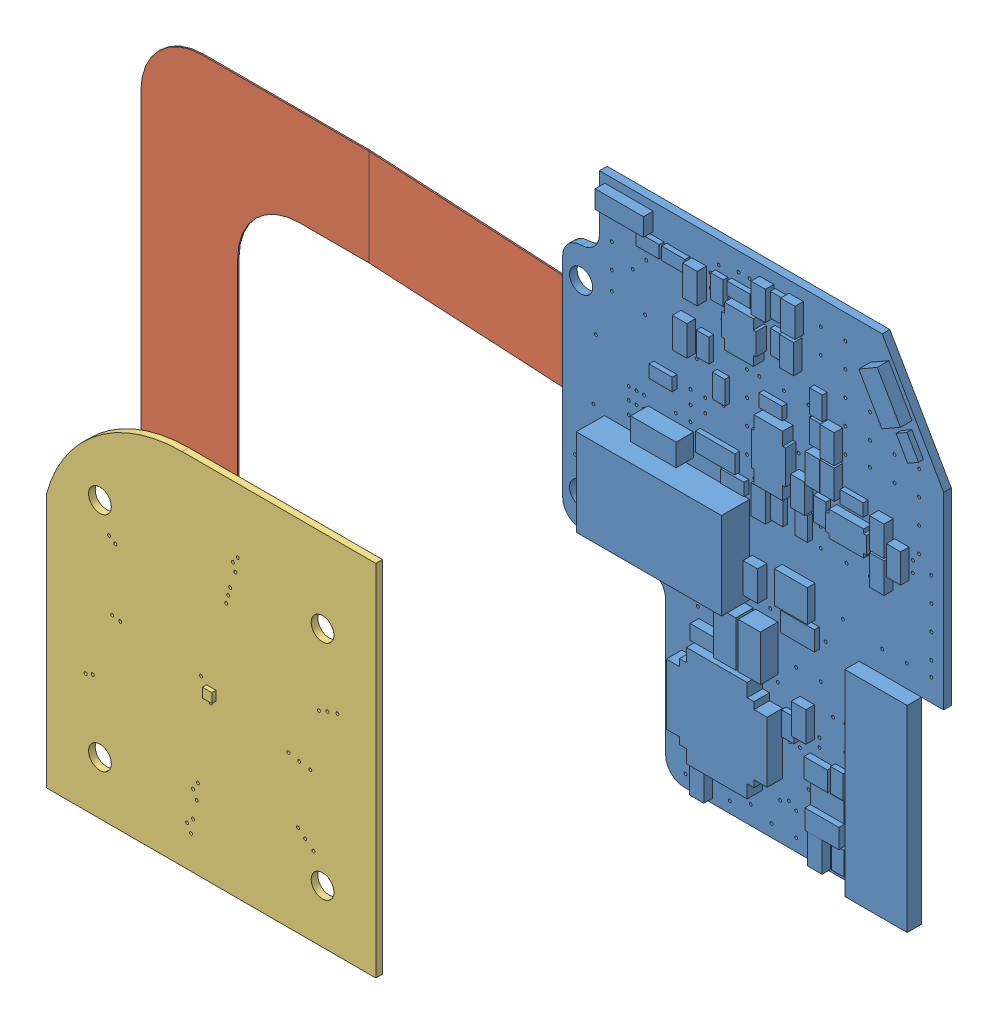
SolidWorks assembly 010900_LnG_heater.SLDASM, configuration Default (file format 12000). Lengths in mm.
Overall size (139.5 99.6 14.01).
3 component instances, 3 part files, 0 mates.
Components (placement in the parent):
- 100221165rC_SolidModel_wFlexPads-1: 100221165rC_SolidModel_wFlexPads.SLDPRT [Default] at (62.72 -3.8 -0.7874) x (0 -1 0) z (0 0 1) size (50.8 39.37 4.74)
- heater_flex-1: heater_flex.SLDPRT [Default] at origin size (139.5 99.6 14.01)
- 100221166rE_3g_puckheater_091222-1: 100221166rE_3g_puckheater_091222.SLDPRT [Default] at (18.2011 -75.0011 -4.4) x (-1 0 0) z (0 0 -1) size (34 37.1 1.14)
